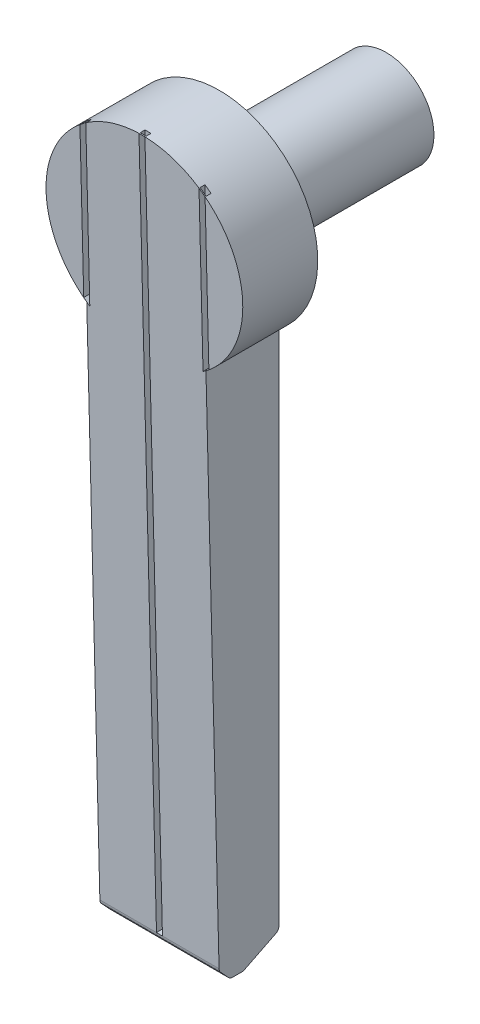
ISO-10303-21;
HEADER;
FILE_DESCRIPTION(('STEP AP214'),'2;1');
FILE_NAME('part.step','',(''),(''),'','','');
FILE_SCHEMA(('AUTOMOTIVE_DESIGN { 1 0 10303 214 1 1 1 1 }'));
ENDSEC;
DATA;
#1=APPLICATION_CONTEXT('core data for automotive mechanical design processes');
#2=APPLICATION_PROTOCOL_DEFINITION('international standard','automotive_design',2000,#1);
#3=PRODUCT_CONTEXT('',#1,'mechanical');
#4=PRODUCT('Part','Part','',(#3));
#5=PRODUCT_RELATED_PRODUCT_CATEGORY('part','',(#4));
#6=PRODUCT_DEFINITION_FORMATION('','',#4);
#7=PRODUCT_DEFINITION_CONTEXT('part definition',#1,'design');
#8=PRODUCT_DEFINITION('design','',#6,#7);
#9=PRODUCT_DEFINITION_SHAPE('','',#8);
#10=(LENGTH_UNIT() NAMED_UNIT(*) SI_UNIT(.MILLI.,.METRE.));
#11=(NAMED_UNIT(*) PLANE_ANGLE_UNIT() SI_UNIT($,.RADIAN.));
#12=(NAMED_UNIT(*) SI_UNIT($,.STERADIAN.) SOLID_ANGLE_UNIT());
#13=UNCERTAINTY_MEASURE_WITH_UNIT(LENGTH_MEASURE(1.E-05),#10,'distance_accuracy_value','');
#14=(GEOMETRIC_REPRESENTATION_CONTEXT(3) GLOBAL_UNCERTAINTY_ASSIGNED_CONTEXT((#13)) GLOBAL_UNIT_ASSIGNED_CONTEXT((#10,
#11,#12)) REPRESENTATION_CONTEXT('',''));
#15=CARTESIAN_POINT('',(0.,0.,0.));
#16=DIRECTION('',(0.,0.,1.));
#17=DIRECTION('',(1.,0.,0.));
#18=AXIS2_PLACEMENT_3D('',#15,#16,#17);
#19=CARTESIAN_POINT('',(240.,60.,13.));
#20=DIRECTION('',(0.,0.0249921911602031,-0.999687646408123));
#21=DIRECTION('',(0.,0.999687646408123,0.0249921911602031));
#22=AXIS2_PLACEMENT_3D('',#19,#20,#21);
#23=PLANE('',#22);
#24=DIRECTION('',(0.,-0.999687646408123,-0.0249921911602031));
#25=VECTOR('',#24,1.);
#26=CARTESIAN_POINT('',(0.500000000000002,-106.057500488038,8.84856248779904));
#27=LINE('',#26,#25);
#28=CARTESIAN_POINT('',(0.500000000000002,59.9872710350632,12.9996817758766));
#29=VERTEX_POINT('',#28);
#30=CARTESIAN_POINT('',(0.500000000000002,-57.6228801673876,10.0594279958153));
#31=VERTEX_POINT('',#30);
#32=EDGE_CURVE('E255',#29,#31,#27,.T.);
#33=ORIENTED_EDGE('',*,*,#32,.T.);
#34=DIRECTION('',(1.,0.,0.));
#35=VECTOR('',#34,1.);
#36=CARTESIAN_POINT('',(240.,-57.6228801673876,10.0594279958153));
#37=LINE('',#36,#35);
#38=CARTESIAN_POINT('',(10.,-57.6228801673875,10.0594279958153));
#39=VERTEX_POINT('',#38);
#40=EDGE_CURVE('E366',#31,#39,#37,.T.);
#41=ORIENTED_EDGE('',*,*,#40,.T.);
#42=DIRECTION('',(0.,-0.999687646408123,-0.0249921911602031));
#43=VECTOR('',#42,1.);
#44=CARTESIAN_POINT('',(10.,-59.9250468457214,10.001873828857));
#45=LINE('',#44,#43);
#46=CARTESIAN_POINT('',(10.,30.3755952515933,12.2593898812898));
#47=VERTEX_POINT('',#46);
#48=EDGE_CURVE('E309',#47,#39,#45,.T.);
#49=ORIENTED_EDGE('',*,*,#48,.F.);
#50=CARTESIAN_POINT('',(0.,43.5,12.5875));
#51=DIRECTION('',(0.,0.0249921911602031,-0.999687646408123));
#52=DIRECTION('',(0.,-0.999687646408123,-0.0249921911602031));
#53=AXIS2_PLACEMENT_3D('',#50,#51,#52);
#54=ELLIPSE('',#53,16.5051554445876,16.5);
#55=CARTESIAN_POINT('',(-10.,30.3755952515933,12.2593898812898));
#56=VERTEX_POINT('',#55);
#57=EDGE_CURVE('E307',#56,#47,#54,.T.);
#58=ORIENTED_EDGE('',*,*,#57,.F.);
#59=DIRECTION('',(0.,0.999687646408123,0.0249921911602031));
#60=VECTOR('',#59,1.);
#61=CARTESIAN_POINT('',(-10.,-59.9250468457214,10.001873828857));
#62=LINE('',#61,#60);
#63=CARTESIAN_POINT('',(-10.,-57.6228801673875,10.0594279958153));
#64=VERTEX_POINT('',#63);
#65=EDGE_CURVE('E312',#64,#56,#62,.T.);
#66=ORIENTED_EDGE('',*,*,#65,.F.);
#67=CARTESIAN_POINT('',(-0.5,-57.6228801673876,10.0594279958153));
#68=VERTEX_POINT('',#67);
#69=EDGE_CURVE('E367',#64,#68,#37,.T.);
#70=ORIENTED_EDGE('',*,*,#69,.T.);
#71=DIRECTION('',(0.,0.999687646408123,0.0249921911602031));
#72=VECTOR('',#71,1.);
#73=CARTESIAN_POINT('',(-0.499999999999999,-106.057500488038,8.84856248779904));
#74=LINE('',#73,#72);
#75=CARTESIAN_POINT('',(-0.499999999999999,59.9872710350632,12.9996817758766));
#76=VERTEX_POINT('',#75);
#77=EDGE_CURVE('E277',#68,#76,#74,.T.);
#78=ORIENTED_EDGE('',*,*,#77,.T.);
#79=CARTESIAN_POINT('',(0.,43.5,12.5875));
#80=DIRECTION('',(0.,-0.0249921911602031,0.999687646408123));
#81=DIRECTION('',(0.,-0.999687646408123,-0.0249921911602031));
#82=AXIS2_PLACEMENT_3D('',#79,#80,#81);
#83=CIRCLE('',#82,16.5);
#84=EDGE_CURVE('E274',#29,#76,#83,.T.);
#85=ORIENTED_EDGE('',*,*,#84,.F.);
#86=EDGE_LOOP('',(#33,#41,#49,#58,#66,#70,#78,#85));
#87=FACE_BOUND('',#86,.T.);
#88=CARTESIAN_POINT('',(0.,43.5,12.5875));
#89=DIRECTION('',(0.,-0.0249921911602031,0.999687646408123));
#90=DIRECTION('',(0.,-0.999687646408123,-0.0249921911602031));
#91=AXIS2_PLACEMENT_3D('',#88,#89,#90);
#92=CIRCLE('',#91,16.5);
#93=CARTESIAN_POINT('',(10.5,56.2239464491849,12.9055986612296));
#94=VERTEX_POINT('',#93);
#95=CARTESIAN_POINT('',(9.50000000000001,56.9865236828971,12.9246630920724));
#96=VERTEX_POINT('',#95);
#97=EDGE_CURVE('E245',#94,#96,#92,.T.);
#98=ORIENTED_EDGE('',*,*,#97,.F.);
#99=DIRECTION('',(0.,0.999687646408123,0.0249921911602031));
#100=VECTOR('',#99,1.);
#101=CARTESIAN_POINT('',(10.5,-106.057500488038,8.84856248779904));
#102=LINE('',#101,#100);
#103=CARTESIAN_POINT('',(10.5,30.7760535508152,12.2694013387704));
#104=VERTEX_POINT('',#103);
#105=EDGE_CURVE('E230',#104,#94,#102,.T.);
#106=ORIENTED_EDGE('',*,*,#105,.F.);
#107=CARTESIAN_POINT('',(0.,43.5,12.5875));
#108=DIRECTION('',(0.,-0.0249921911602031,0.999687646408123));
#109=DIRECTION('',(0.,-0.999687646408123,-0.0249921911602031));
#110=AXIS2_PLACEMENT_3D('',#107,#108,#109);
#111=CIRCLE('',#110,16.5);
#112=CARTESIAN_POINT('',(9.50000000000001,30.0134763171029,12.2503369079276));
#113=VERTEX_POINT('',#112);
#114=EDGE_CURVE('E237',#113,#104,#111,.T.);
#115=ORIENTED_EDGE('',*,*,#114,.F.);
#116=DIRECTION('',(0.,0.999687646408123,0.0249921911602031));
#117=VECTOR('',#116,1.);
#118=CARTESIAN_POINT('',(9.50000000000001,-106.057500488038,8.84856248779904));
#119=LINE('',#118,#117);
#120=EDGE_CURVE('E248',#113,#96,#119,.T.);
#121=ORIENTED_EDGE('',*,*,#120,.T.);
#122=EDGE_LOOP('',(#98,#106,#115,#121));
#123=FACE_BOUND('',#122,.T.);
#124=CARTESIAN_POINT('',(0.,43.5,12.5875));
#125=DIRECTION('',(0.,-0.0249921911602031,0.999687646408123));
#126=DIRECTION('',(0.,-0.999687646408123,-0.0249921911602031));
#127=AXIS2_PLACEMENT_3D('',#124,#125,#126);
#128=CIRCLE('',#127,16.5);
#129=CARTESIAN_POINT('',(-9.49999999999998,30.0134763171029,12.2503369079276));
#130=VERTEX_POINT('',#129);
#131=CARTESIAN_POINT('',(-10.5,30.7760535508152,12.2694013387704));
#132=VERTEX_POINT('',#131);
#133=EDGE_CURVE('E47',#130,#132,#128,.F.);
#134=ORIENTED_EDGE('',*,*,#133,.T.);
#135=DIRECTION('',(0.,0.999687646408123,0.0249921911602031));
#136=VECTOR('',#135,1.);
#137=CARTESIAN_POINT('',(-10.5,-106.057500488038,8.84856248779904));
#138=LINE('',#137,#136);
#139=CARTESIAN_POINT('',(-10.5,56.2239464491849,12.9055986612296));
#140=VERTEX_POINT('',#139);
#141=EDGE_CURVE('E210',#132,#140,#138,.T.);
#142=ORIENTED_EDGE('',*,*,#141,.T.);
#143=CARTESIAN_POINT('',(0.,43.5,12.5875));
#144=DIRECTION('',(0.,-0.0249921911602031,0.999687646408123));
#145=DIRECTION('',(0.,-0.999687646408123,-0.0249921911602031));
#146=AXIS2_PLACEMENT_3D('',#143,#144,#145);
#147=CIRCLE('',#146,16.5);
#148=CARTESIAN_POINT('',(-9.49999999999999,56.9865236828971,12.9246630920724));
#149=VERTEX_POINT('',#148);
#150=EDGE_CURVE('E223',#149,#140,#147,.T.);
#151=ORIENTED_EDGE('',*,*,#150,.F.);
#152=DIRECTION('',(0.,0.999687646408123,0.0249921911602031));
#153=VECTOR('',#152,1.);
#154=CARTESIAN_POINT('',(-9.50000000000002,-106.057500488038,8.84856248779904));
#155=LINE('',#154,#153);
#156=EDGE_CURVE('E221',#130,#149,#155,.T.);
#157=ORIENTED_EDGE('',*,*,#156,.F.);
#158=EDGE_LOOP('',(#134,#142,#151,#157));
#159=FACE_BOUND('',#158,.T.);
#160=ADVANCED_FACE('F32',(#87,#123,#159),#23,.F.);
#161=CARTESIAN_POINT('',(0.,43.5,13.));
#162=DIRECTION('',(0.,0.,-1.));
#163=DIRECTION('',(-1.,0.,0.));
#164=AXIS2_PLACEMENT_3D('',#161,#162,#163);
#165=CYLINDRICAL_SURFACE('',#164,16.5);
#166=DIRECTION('',(0.,0.,-1.));
#167=VECTOR('',#166,1.);
#168=CARTESIAN_POINT('',(-10.,30.3755952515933,13.));
#169=LINE('',#168,#167);
#170=CARTESIAN_POINT('',(-10.,30.3755952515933,0.));
#171=VERTEX_POINT('',#170);
#172=EDGE_CURVE('E325',#56,#171,#169,.T.);
#173=ORIENTED_EDGE('',*,*,#172,.F.);
#174=ORIENTED_EDGE('',*,*,#57,.T.);
#175=DIRECTION('',(0.,0.,-1.));
#176=VECTOR('',#175,1.);
#177=CARTESIAN_POINT('',(10.,30.3755952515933,13.));
#178=LINE('',#177,#176);
#179=CARTESIAN_POINT('',(10.,30.3755952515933,0.));
#180=VERTEX_POINT('',#179);
#181=EDGE_CURVE('E327',#47,#180,#178,.T.);
#182=ORIENTED_EDGE('',*,*,#181,.T.);
#183=CARTESIAN_POINT('',(0.,43.5,0.));
#184=DIRECTION('',(0.,0.,1.));
#185=DIRECTION('',(1.,0.,0.));
#186=AXIS2_PLACEMENT_3D('',#183,#184,#185);
#187=CIRCLE('',#186,16.5);
#188=EDGE_CURVE('E322',#180,#171,#187,.T.);
#189=ORIENTED_EDGE('',*,*,#188,.T.);
#190=EDGE_LOOP('',(#173,#174,#182,#189));
#191=FACE_BOUND('',#190,.T.);
#192=DIRECTION('',(0.,0.,-1.));
#193=VECTOR('',#192,1.);
#194=CARTESIAN_POINT('',(0.500000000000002,59.9924225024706,13.));
#195=LINE('',#194,#193);
#196=CARTESIAN_POINT('',(0.500000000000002,59.9924225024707,12.7936230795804));
#197=VERTEX_POINT('',#196);
#198=CARTESIAN_POINT('',(0.500000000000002,59.9924225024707,11.9994981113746));
#199=VERTEX_POINT('',#198);
#200=EDGE_CURVE('E292',#197,#199,#195,.T.);
#201=ORIENTED_EDGE('',*,*,#200,.F.);
#202=CARTESIAN_POINT('',(0.,43.5,12.5875));
#203=DIRECTION('',(0.,0.0124970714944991,-0.999921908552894));
#204=DIRECTION('',(0.,-0.999921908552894,-0.0124970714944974));
#205=AXIS2_PLACEMENT_3D('',#202,#203,#204);
#206=ELLIPSE('',#205,16.5012886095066,16.5);
#207=CARTESIAN_POINT('',(-0.499999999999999,59.9924225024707,12.7936230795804));
#208=VERTEX_POINT('',#207);
#209=EDGE_CURVE('E295',#197,#208,#206,.F.);
#210=ORIENTED_EDGE('',*,*,#209,.T.);
#211=DIRECTION('',(0.,0.,-1.));
#212=VECTOR('',#211,1.);
#213=CARTESIAN_POINT('',(-0.499999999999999,59.9924225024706,13.));
#214=LINE('',#213,#212);
#215=CARTESIAN_POINT('',(-0.499999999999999,59.9924225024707,11.9994981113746));
#216=VERTEX_POINT('',#215);
#217=EDGE_CURVE('E284',#216,#208,#214,.F.);
#218=ORIENTED_EDGE('',*,*,#217,.F.);
#219=CARTESIAN_POINT('',(0.,43.5,11.5871875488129));
#220=DIRECTION('',(0.,-0.0249921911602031,0.999687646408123));
#221=DIRECTION('',(0.,-0.999687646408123,-0.0249921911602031));
#222=AXIS2_PLACEMENT_3D('',#219,#220,#221);
#223=ELLIPSE('',#222,16.5051554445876,16.5);
#224=EDGE_CURVE('E379',#199,#216,#223,.T.);
#225=ORIENTED_EDGE('',*,*,#224,.F.);
#226=EDGE_LOOP('',(#201,#210,#218,#225));
#227=FACE_BOUND('',#226,.T.);
#228=DIRECTION('',(0.,0.,-1.));
#229=VECTOR('',#228,1.);
#230=CARTESIAN_POINT('',(10.5,56.2279220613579,13.));
#231=LINE('',#230,#229);
#232=CARTESIAN_POINT('',(10.5,56.2279220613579,11.9053856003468));
#233=VERTEX_POINT('',#232);
#234=CARTESIAN_POINT('',(10.5,56.2279220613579,12.7465741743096));
#235=VERTEX_POINT('',#234);
#236=EDGE_CURVE('E385',#233,#235,#231,.F.);
#237=ORIENTED_EDGE('',*,*,#236,.T.);
#238=CARTESIAN_POINT('',(0.,43.5,12.5875));
#239=DIRECTION('',(0.,0.0124970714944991,-0.999921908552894));
#240=DIRECTION('',(0.,-0.999921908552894,-0.0124970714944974));
#241=AXIS2_PLACEMENT_3D('',#238,#239,#240);
#242=ELLIPSE('',#241,16.5012886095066,16.5);
#243=CARTESIAN_POINT('',(9.50000000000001,56.9907375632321,12.7561078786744));
#244=VERTEX_POINT('',#243);
#245=EDGE_CURVE('E388',#235,#244,#242,.F.);
#246=ORIENTED_EDGE('',*,*,#245,.T.);
#247=DIRECTION('',(0.,0.,-1.));
#248=VECTOR('',#247,1.);
#249=CARTESIAN_POINT('',(9.50000000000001,56.990737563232,13.));
#250=LINE('',#249,#248);
#251=CARTESIAN_POINT('',(9.50000000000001,56.9907375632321,11.9244559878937));
#252=VERTEX_POINT('',#251);
#253=EDGE_CURVE('E383',#252,#244,#250,.F.);
#254=ORIENTED_EDGE('',*,*,#253,.F.);
#255=CARTESIAN_POINT('',(0.,43.5,11.5871875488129));
#256=DIRECTION('',(0.,-0.0249921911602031,0.999687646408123));
#257=DIRECTION('',(0.,-0.999687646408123,-0.0249921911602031));
#258=AXIS2_PLACEMENT_3D('',#255,#256,#257);
#259=ELLIPSE('',#258,16.5051554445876,16.5);
#260=EDGE_CURVE('E381',#233,#252,#259,.T.);
#261=ORIENTED_EDGE('',*,*,#260,.F.);
#262=EDGE_LOOP('',(#237,#246,#254,#261));
#263=FACE_BOUND('',#262,.T.);
#264=DIRECTION('',(0.,0.,-1.));
#265=VECTOR('',#264,1.);
#266=CARTESIAN_POINT('',(-10.5,56.2279220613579,13.));
#267=LINE('',#266,#265);
#268=CARTESIAN_POINT('',(-10.5,56.2279220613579,11.9053856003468));
#269=VERTEX_POINT('',#268);
#270=CARTESIAN_POINT('',(-10.5,56.2279220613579,12.7465741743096));
#271=VERTEX_POINT('',#270);
#272=EDGE_CURVE('E11',#269,#271,#267,.F.);
#273=ORIENTED_EDGE('',*,*,#272,.F.);
#274=CARTESIAN_POINT('',(0.,43.5,11.5871875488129));
#275=DIRECTION('',(0.,-0.0249921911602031,0.999687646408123));
#276=DIRECTION('',(0.,-0.999687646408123,-0.0249921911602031));
#277=AXIS2_PLACEMENT_3D('',#274,#275,#276);
#278=ELLIPSE('',#277,16.5051554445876,16.5);
#279=CARTESIAN_POINT('',(-9.49999999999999,56.9907375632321,11.9244559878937));
#280=VERTEX_POINT('',#279);
#281=EDGE_CURVE('E391',#280,#269,#278,.T.);
#282=ORIENTED_EDGE('',*,*,#281,.F.);
#283=DIRECTION('',(0.,0.,-1.));
#284=VECTOR('',#283,1.);
#285=CARTESIAN_POINT('',(-9.49999999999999,56.990737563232,13.));
#286=LINE('',#285,#284);
#287=CARTESIAN_POINT('',(-9.49999999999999,56.990737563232,12.7561078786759));
#288=VERTEX_POINT('',#287);
#289=EDGE_CURVE('E215',#280,#288,#286,.F.);
#290=ORIENTED_EDGE('',*,*,#289,.T.);
#291=CARTESIAN_POINT('',(0.,43.5,12.5875));
#292=DIRECTION('',(0.,0.0124970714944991,-0.999921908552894));
#293=DIRECTION('',(0.,-0.999921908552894,-0.0124970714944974));
#294=AXIS2_PLACEMENT_3D('',#291,#292,#293);
#295=ELLIPSE('',#294,16.5012886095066,16.5);
#296=EDGE_CURVE('E40',#288,#271,#295,.F.);
#297=ORIENTED_EDGE('',*,*,#296,.T.);
#298=EDGE_LOOP('',(#273,#282,#290,#297));
#299=FACE_BOUND('',#298,.T.);
#300=ADVANCED_FACE('F396',(#191,#227,#263,#299),#165,.T.);
#301=CARTESIAN_POINT('',(0.,43.5,0.));
#302=DIRECTION('',(0.,0.,1.));
#303=DIRECTION('',(1.,0.,0.));
#304=AXIS2_PLACEMENT_3D('',#301,#302,#303);
#305=PLANE('',#304);
#306=DIRECTION('',(0.,1.,0.));
#307=VECTOR('',#306,1.);
#308=CARTESIAN_POINT('',(10.,-60.,0.));
#309=LINE('',#308,#307);
#310=CARTESIAN_POINT('',(10.,-56.3819660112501,0.));
#311=VERTEX_POINT('',#310);
#312=EDGE_CURVE('E320',#311,#180,#309,.T.);
#313=ORIENTED_EDGE('',*,*,#312,.F.);
#314=DIRECTION('',(-1.,0.,0.));
#315=VECTOR('',#314,1.);
#316=CARTESIAN_POINT('',(0.,-56.3819660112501,0.));
#317=LINE('',#316,#315);
#318=CARTESIAN_POINT('',(-10.,-56.3819660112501,0.));
#319=VERTEX_POINT('',#318);
#320=EDGE_CURVE('E342',#311,#319,#317,.T.);
#321=ORIENTED_EDGE('',*,*,#320,.T.);
#322=DIRECTION('',(0.,-1.,0.));
#323=VECTOR('',#322,1.);
#324=CARTESIAN_POINT('',(-10.,-60.,0.));
#325=LINE('',#324,#323);
#326=EDGE_CURVE('E317',#171,#319,#325,.T.);
#327=ORIENTED_EDGE('',*,*,#326,.F.);
#328=ORIENTED_EDGE('',*,*,#188,.F.);
#329=EDGE_LOOP('',(#313,#321,#327,#328));
#330=FACE_BOUND('',#329,.T.);
#331=CARTESIAN_POINT('',(0.,43.5,0.));
#332=DIRECTION('',(0.,0.,1.));
#333=DIRECTION('',(1.,0.,0.));
#334=AXIS2_PLACEMENT_3D('',#331,#332,#333);
#335=CIRCLE('',#334,8.);
#336=CARTESIAN_POINT('',(8.00000000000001,43.5,0.));
#337=VERTEX_POINT('',#336);
#338=EDGE_CURVE('E336',#337,#337,#335,.F.);
#339=ORIENTED_EDGE('',*,*,#338,.F.);
#340=EDGE_LOOP('',(#339));
#341=FACE_BOUND('',#340,.T.);
#342=ADVANCED_FACE('F422',(#330,#341),#305,.F.);
#343=CARTESIAN_POINT('',(-10.,-60.,13.));
#344=DIRECTION('',(1.,0.,0.));
#345=DIRECTION('',(0.,0.,-1.));
#346=AXIS2_PLACEMENT_3D('',#343,#344,#345);
#347=PLANE('',#346);
#348=ORIENTED_EDGE('',*,*,#326,.T.);
#349=CARTESIAN_POINT('',(-10.,-56.3819660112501,1.));
#350=DIRECTION('',(1.,0.,0.));
#351=DIRECTION('',(0.,0.,-1.));
#352=AXIS2_PLACEMENT_3D('',#349,#350,#351);
#353=CIRCLE('',#352,1.);
#354=CARTESIAN_POINT('',(-10.,-57.27639320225,0.552786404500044));
#355=VERTEX_POINT('',#354);
#356=EDGE_CURVE('E351',#319,#355,#353,.F.);
#357=ORIENTED_EDGE('',*,*,#356,.T.);
#358=DIRECTION('',(0.,0.447213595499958,-0.894427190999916));
#359=VECTOR('',#358,1.);
#360=CARTESIAN_POINT('',(-10.,-60.,6.));
#361=LINE('',#360,#359);
#362=CARTESIAN_POINT('',(-10.,-59.8944271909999,5.78885438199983));
#363=VERTEX_POINT('',#362);
#364=EDGE_CURVE('E298',#363,#355,#361,.T.);
#365=ORIENTED_EDGE('',*,*,#364,.F.);
#366=CARTESIAN_POINT('',(-10.,-59.,6.23606797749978));
#367=DIRECTION('',(1.,0.,0.));
#368=DIRECTION('',(0.,0.,-1.));
#369=AXIS2_PLACEMENT_3D('',#366,#367,#368);
#370=CIRCLE('',#369,1.);
#371=CARTESIAN_POINT('',(-10.,-60.,6.23606797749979));
#372=VERTEX_POINT('',#371);
#373=EDGE_CURVE('E345',#363,#372,#370,.F.);
#374=ORIENTED_EDGE('',*,*,#373,.T.);
#375=DIRECTION('',(0.,0.,-1.));
#376=VECTOR('',#375,1.);
#377=CARTESIAN_POINT('',(-10.,-60.,13.));
#378=LINE('',#377,#376);
#379=CARTESIAN_POINT('',(-10.,-60.,7.76278672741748));
#380=VERTEX_POINT('',#379);
#381=EDGE_CURVE('E333',#380,#372,#378,.T.);
#382=ORIENTED_EDGE('',*,*,#381,.F.);
#383=CARTESIAN_POINT('',(-10.,-59.,7.76278672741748));
#384=DIRECTION('',(1.,0.,0.));
#385=DIRECTION('',(0.,0.,-1.));
#386=AXIS2_PLACEMENT_3D('',#383,#384,#385);
#387=CIRCLE('',#386,1.);
#388=CARTESIAN_POINT('',(-10.,-59.6790419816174,8.49688616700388));
#389=VERTEX_POINT('',#388);
#390=EDGE_CURVE('E347',#380,#389,#387,.F.);
#391=ORIENTED_EDGE('',*,*,#390,.T.);
#392=DIRECTION('',(0.,-0.734099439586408,-0.679041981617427));
#393=VECTOR('',#392,1.);
#394=CARTESIAN_POINT('',(-10.,-58.,10.05));
#395=LINE('',#394,#393);
#396=CARTESIAN_POINT('',(-10.,-58.2769299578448,9.79383978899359));
#397=VERTEX_POINT('',#396);
#398=EDGE_CURVE('E301',#397,#389,#395,.T.);
#399=ORIENTED_EDGE('',*,*,#398,.F.);
#400=CARTESIAN_POINT('',(-10.,-57.5978879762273,9.05974034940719));
#401=DIRECTION('',(1.,0.,0.));
#402=DIRECTION('',(0.,0.,-1.));
#403=AXIS2_PLACEMENT_3D('',#400,#401,#402);
#404=CIRCLE('',#403,1.);
#405=EDGE_CURVE('E349',#397,#64,#404,.F.);
#406=ORIENTED_EDGE('',*,*,#405,.T.);
#407=ORIENTED_EDGE('',*,*,#65,.T.);
#408=ORIENTED_EDGE('',*,*,#172,.T.);
#409=EDGE_LOOP('',(#348,#357,#365,#374,#382,#391,#399,#406,#407,#408));
#410=FACE_BOUND('',#409,.T.);
#411=ADVANCED_FACE('F440',(#410),#347,.F.);
#412=CARTESIAN_POINT('',(-10.,-60.,13.));
#413=DIRECTION('',(0.,1.,0.));
#414=DIRECTION('',(0.,0.,1.));
#415=AXIS2_PLACEMENT_3D('',#412,#413,#414);
#416=PLANE('',#415);
#417=DIRECTION('',(0.,0.,-1.));
#418=VECTOR('',#417,1.);
#419=CARTESIAN_POINT('',(10.,-60.,13.));
#420=LINE('',#419,#418);
#421=CARTESIAN_POINT('',(10.,-60.,7.76278672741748));
#422=VERTEX_POINT('',#421);
#423=CARTESIAN_POINT('',(10.,-60.,6.23606797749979));
#424=VERTEX_POINT('',#423);
#425=EDGE_CURVE('E330',#422,#424,#420,.T.);
#426=ORIENTED_EDGE('',*,*,#425,.F.);
#427=DIRECTION('',(-1.,0.,0.));
#428=VECTOR('',#427,1.);
#429=CARTESIAN_POINT('',(-10.,-60.,7.76278672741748));
#430=LINE('',#429,#428);
#431=EDGE_CURVE('E376',#422,#380,#430,.T.);
#432=ORIENTED_EDGE('',*,*,#431,.T.);
#433=ORIENTED_EDGE('',*,*,#381,.T.);
#434=DIRECTION('',(-1.,0.,0.));
#435=VECTOR('',#434,1.);
#436=CARTESIAN_POINT('',(-10.,-60.,6.23606797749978));
#437=LINE('',#436,#435);
#438=EDGE_CURVE('E374',#372,#424,#437,.F.);
#439=ORIENTED_EDGE('',*,*,#438,.T.);
#440=EDGE_LOOP('',(#426,#432,#433,#439));
#441=FACE_BOUND('',#440,.T.);
#442=ADVANCED_FACE('F445',(#441),#416,.F.);
#443=CARTESIAN_POINT('',(10.,-60.,13.));
#444=DIRECTION('',(-1.,0.,0.));
#445=DIRECTION('',(0.,0.,1.));
#446=AXIS2_PLACEMENT_3D('',#443,#444,#445);
#447=PLANE('',#446);
#448=DIRECTION('',(0.,0.447213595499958,-0.894427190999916));
#449=VECTOR('',#448,1.);
#450=CARTESIAN_POINT('',(10.,-62.8,11.6));
#451=LINE('',#450,#449);
#452=CARTESIAN_POINT('',(10.,-59.8944271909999,5.78885438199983));
#453=VERTEX_POINT('',#452);
#454=CARTESIAN_POINT('',(10.,-57.27639320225,0.552786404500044));
#455=VERTEX_POINT('',#454);
#456=EDGE_CURVE('E339',#453,#455,#451,.T.);
#457=ORIENTED_EDGE('',*,*,#456,.T.);
#458=CARTESIAN_POINT('',(10.,-56.3819660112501,1.));
#459=DIRECTION('',(-1.,0.,0.));
#460=DIRECTION('',(0.,0.,1.));
#461=AXIS2_PLACEMENT_3D('',#458,#459,#460);
#462=CIRCLE('',#461,1.);
#463=EDGE_CURVE('E364',#455,#311,#462,.F.);
#464=ORIENTED_EDGE('',*,*,#463,.T.);
#465=ORIENTED_EDGE('',*,*,#312,.T.);
#466=ORIENTED_EDGE('',*,*,#181,.F.);
#467=ORIENTED_EDGE('',*,*,#48,.T.);
#468=CARTESIAN_POINT('',(10.,-57.5978879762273,9.05974034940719));
#469=DIRECTION('',(-1.,0.,0.));
#470=DIRECTION('',(0.,0.,1.));
#471=AXIS2_PLACEMENT_3D('',#468,#469,#470);
#472=CIRCLE('',#471,1.);
#473=CARTESIAN_POINT('',(10.,-58.2769299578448,9.79383978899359));
#474=VERTEX_POINT('',#473);
#475=EDGE_CURVE('E362',#39,#474,#472,.F.);
#476=ORIENTED_EDGE('',*,*,#475,.T.);
#477=DIRECTION('',(0.,-0.734099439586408,-0.679041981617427));
#478=VECTOR('',#477,1.);
#479=CARTESIAN_POINT('',(10.,-57.6072751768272,10.4132704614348));
#480=LINE('',#479,#478);
#481=CARTESIAN_POINT('',(10.,-59.6790419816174,8.49688616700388));
#482=VERTEX_POINT('',#481);
#483=EDGE_CURVE('E304',#474,#482,#480,.T.);
#484=ORIENTED_EDGE('',*,*,#483,.T.);
#485=CARTESIAN_POINT('',(10.,-59.,7.76278672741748));
#486=DIRECTION('',(-1.,0.,0.));
#487=DIRECTION('',(0.,0.,1.));
#488=AXIS2_PLACEMENT_3D('',#485,#486,#487);
#489=CIRCLE('',#488,1.);
#490=EDGE_CURVE('E360',#482,#422,#489,.F.);
#491=ORIENTED_EDGE('',*,*,#490,.T.);
#492=ORIENTED_EDGE('',*,*,#425,.T.);
#493=CARTESIAN_POINT('',(10.,-59.,6.23606797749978));
#494=DIRECTION('',(-1.,0.,0.));
#495=DIRECTION('',(0.,0.,1.));
#496=AXIS2_PLACEMENT_3D('',#493,#494,#495);
#497=CIRCLE('',#496,1.);
#498=EDGE_CURVE('E358',#424,#453,#497,.F.);
#499=ORIENTED_EDGE('',*,*,#498,.T.);
#500=EDGE_LOOP('',(#457,#464,#465,#466,#467,#476,#484,#491,#492,#499));
#501=FACE_BOUND('',#500,.T.);
#502=ADVANCED_FACE('F437',(#501),#447,.F.);
#503=CARTESIAN_POINT('',(0.,43.5,-28.));
#504=DIRECTION('',(0.,0.,1.));
#505=DIRECTION('',(1.,0.,0.));
#506=AXIS2_PLACEMENT_3D('',#503,#504,#505);
#507=CYLINDRICAL_SURFACE('',#506,8.);
#508=CARTESIAN_POINT('',(0.,43.5,-28.));
#509=DIRECTION('',(0.,0.,-1.));
#510=DIRECTION('',(-1.,0.,0.));
#511=AXIS2_PLACEMENT_3D('',#508,#509,#510);
#512=CIRCLE('',#511,8.);
#513=CARTESIAN_POINT('',(-7.99999999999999,43.5,-28.));
#514=VERTEX_POINT('',#513);
#515=EDGE_CURVE('E314',#514,#514,#512,.T.);
#516=ORIENTED_EDGE('',*,*,#515,.F.);
#517=EDGE_LOOP('',(#516));
#518=FACE_BOUND('',#517,.T.);
#519=ORIENTED_EDGE('',*,*,#338,.T.);
#520=EDGE_LOOP('',(#519));
#521=FACE_BOUND('',#520,.T.);
#522=ADVANCED_FACE('F433',(#518,#521),#507,.T.);
#523=CARTESIAN_POINT('',(0.,43.5,-28.));
#524=DIRECTION('',(0.,0.,-1.));
#525=DIRECTION('',(-1.,0.,0.));
#526=AXIS2_PLACEMENT_3D('',#523,#524,#525);
#527=PLANE('',#526);
#528=ORIENTED_EDGE('',*,*,#515,.T.);
#529=EDGE_LOOP('',(#528));
#530=FACE_BOUND('',#529,.T.);
#531=ADVANCED_FACE('F430',(#530),#527,.T.);
#532=CARTESIAN_POINT('',(16.5,-58.,10.05));
#533=DIRECTION('',(0.,0.679041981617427,-0.734099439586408));
#534=DIRECTION('',(0.,0.734099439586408,0.679041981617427));
#535=AXIS2_PLACEMENT_3D('',#532,#533,#534);
#536=PLANE('',#535);
#537=ORIENTED_EDGE('',*,*,#483,.F.);
#538=DIRECTION('',(1.,0.,0.));
#539=VECTOR('',#538,1.);
#540=CARTESIAN_POINT('',(16.5,-58.2769299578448,9.79383978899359));
#541=LINE('',#540,#539);
#542=EDGE_CURVE('E372',#474,#397,#541,.F.);
#543=ORIENTED_EDGE('',*,*,#542,.T.);
#544=ORIENTED_EDGE('',*,*,#398,.T.);
#545=DIRECTION('',(-1.,0.,0.));
#546=VECTOR('',#545,1.);
#547=CARTESIAN_POINT('',(16.5,-59.6790419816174,8.49688616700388));
#548=LINE('',#547,#546);
#549=EDGE_CURVE('E370',#389,#482,#548,.F.);
#550=ORIENTED_EDGE('',*,*,#549,.T.);
#551=EDGE_LOOP('',(#537,#543,#544,#550));
#552=FACE_BOUND('',#551,.T.);
#553=ADVANCED_FACE('F428',(#552),#536,.F.);
#554=CARTESIAN_POINT('',(16.5,-60.,6.));
#555=DIRECTION('',(0.,0.894427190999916,0.447213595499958));
#556=DIRECTION('',(0.,-0.447213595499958,0.894427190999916));
#557=AXIS2_PLACEMENT_3D('',#554,#555,#556);
#558=PLANE('',#557);
#559=ORIENTED_EDGE('',*,*,#364,.T.);
#560=DIRECTION('',(-1.,0.,0.));
#561=VECTOR('',#560,1.);
#562=CARTESIAN_POINT('',(16.5,-57.27639320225,0.552786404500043));
#563=LINE('',#562,#561);
#564=EDGE_CURVE('E356',#355,#455,#563,.F.);
#565=ORIENTED_EDGE('',*,*,#564,.T.);
#566=ORIENTED_EDGE('',*,*,#456,.F.);
#567=DIRECTION('',(-1.,0.,0.));
#568=VECTOR('',#567,1.);
#569=CARTESIAN_POINT('',(16.5,-59.8944271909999,5.78885438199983));
#570=LINE('',#569,#568);
#571=EDGE_CURVE('E353',#453,#363,#570,.T.);
#572=ORIENTED_EDGE('',*,*,#571,.T.);
#573=EDGE_LOOP('',(#559,#565,#566,#572));
#574=FACE_BOUND('',#573,.T.);
#575=ADVANCED_FACE('F457',(#574),#558,.F.);
#576=CARTESIAN_POINT('',(0.,-56.3819660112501,1.));
#577=DIRECTION('',(-1.,0.,0.));
#578=DIRECTION('',(0.,0.,1.));
#579=AXIS2_PLACEMENT_3D('',#576,#577,#578);
#580=CYLINDRICAL_SURFACE('',#579,1.);
#581=ORIENTED_EDGE('',*,*,#463,.F.);
#582=ORIENTED_EDGE('',*,*,#564,.F.);
#583=ORIENTED_EDGE('',*,*,#356,.F.);
#584=ORIENTED_EDGE('',*,*,#320,.F.);
#585=EDGE_LOOP('',(#581,#582,#583,#584));
#586=FACE_BOUND('',#585,.T.);
#587=ADVANCED_FACE('F453',(#586),#580,.T.);
#588=CARTESIAN_POINT('',(240.,-57.5978879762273,9.05974034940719));
#589=DIRECTION('',(1.,0.,0.));
#590=DIRECTION('',(0.,0.,-1.));
#591=AXIS2_PLACEMENT_3D('',#588,#589,#590);
#592=CYLINDRICAL_SURFACE('',#591,1.);
#593=ORIENTED_EDGE('',*,*,#405,.F.);
#594=ORIENTED_EDGE('',*,*,#542,.F.);
#595=ORIENTED_EDGE('',*,*,#475,.F.);
#596=ORIENTED_EDGE('',*,*,#40,.F.);
#597=DIRECTION('',(1.,0.,0.));
#598=VECTOR('',#597,1.);
#599=CARTESIAN_POINT('',(0.41236673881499,-57.6228801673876,10.0594279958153));
#600=LINE('',#599,#598);
#601=EDGE_CURVE('E265',#68,#31,#600,.T.);
#602=ORIENTED_EDGE('',*,*,#601,.F.);
#603=ORIENTED_EDGE('',*,*,#69,.F.);
#604=EDGE_LOOP('',(#593,#594,#595,#596,#602,#603));
#605=FACE_BOUND('',#604,.T.);
#606=ADVANCED_FACE('F456',(#605),#592,.T.);
#607=CARTESIAN_POINT('',(-10.,-59.,7.76278672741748));
#608=DIRECTION('',(-1.,0.,0.));
#609=DIRECTION('',(0.,0.,1.));
#610=AXIS2_PLACEMENT_3D('',#607,#608,#609);
#611=CYLINDRICAL_SURFACE('',#610,1.);
#612=ORIENTED_EDGE('',*,*,#490,.F.);
#613=ORIENTED_EDGE('',*,*,#549,.F.);
#614=ORIENTED_EDGE('',*,*,#390,.F.);
#615=ORIENTED_EDGE('',*,*,#431,.F.);
#616=EDGE_LOOP('',(#612,#613,#614,#615));
#617=FACE_BOUND('',#616,.T.);
#618=ADVANCED_FACE('F460',(#617),#611,.T.);
#619=CARTESIAN_POINT('',(16.5,-59.,6.23606797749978));
#620=DIRECTION('',(-1.,0.,0.));
#621=DIRECTION('',(0.,0.,1.));
#622=AXIS2_PLACEMENT_3D('',#619,#620,#621);
#623=CYLINDRICAL_SURFACE('',#622,1.);
#624=ORIENTED_EDGE('',*,*,#498,.F.);
#625=ORIENTED_EDGE('',*,*,#438,.F.);
#626=ORIENTED_EDGE('',*,*,#373,.F.);
#627=ORIENTED_EDGE('',*,*,#571,.F.);
#628=EDGE_LOOP('',(#624,#625,#626,#627));
#629=FACE_BOUND('',#628,.T.);
#630=ADVANCED_FACE('F34',(#629),#623,.T.);
#631=CARTESIAN_POINT('',(0.41236673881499,-106.032508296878,7.84887484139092));
#632=DIRECTION('',(0.,-0.0249921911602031,0.999687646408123));
#633=DIRECTION('',(0.,-0.999687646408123,-0.0249921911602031));
#634=AXIS2_PLACEMENT_3D('',#631,#632,#633);
#635=PLANE('',#634);
#636=ORIENTED_EDGE('',*,*,#224,.T.);
#637=DIRECTION('',(0.,0.999687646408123,0.0249921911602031));
#638=VECTOR('',#637,1.);
#639=CARTESIAN_POINT('',(-0.499999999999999,-106.032508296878,7.84887484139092));
#640=LINE('',#639,#638);
#641=CARTESIAN_POINT('',(-0.499999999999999,-57.5978879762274,9.05974034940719));
#642=VERTEX_POINT('',#641);
#643=EDGE_CURVE('E264',#642,#216,#640,.T.);
#644=ORIENTED_EDGE('',*,*,#643,.F.);
#645=DIRECTION('',(1.,0.,0.));
#646=VECTOR('',#645,1.);
#647=CARTESIAN_POINT('',(0.41236673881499,-57.5978879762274,9.05974034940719));
#648=LINE('',#647,#646);
#649=CARTESIAN_POINT('',(0.500000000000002,-57.5978879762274,9.05974034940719));
#650=VERTEX_POINT('',#649);
#651=EDGE_CURVE('E268',#642,#650,#648,.T.);
#652=ORIENTED_EDGE('',*,*,#651,.T.);
#653=DIRECTION('',(0.,-0.999687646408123,-0.0249921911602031));
#654=VECTOR('',#653,1.);
#655=CARTESIAN_POINT('',(0.500000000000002,-106.032508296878,7.84887484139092));
#656=LINE('',#655,#654);
#657=EDGE_CURVE('E262',#199,#650,#656,.T.);
#658=ORIENTED_EDGE('',*,*,#657,.F.);
#659=EDGE_LOOP('',(#636,#644,#652,#658));
#660=FACE_BOUND('',#659,.T.);
#661=ADVANCED_FACE('F467',(#660),#635,.T.);
#662=CARTESIAN_POINT('',(0.,43.5249921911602,11.5878123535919));
#663=DIRECTION('',(0.,-0.0249921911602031,0.999687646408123));
#664=DIRECTION('',(0.,-0.999687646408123,-0.0249921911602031));
#665=AXIS2_PLACEMENT_3D('',#662,#663,#664);
#666=CYLINDRICAL_SURFACE('',#665,16.5);
#667=DIRECTION('',(0.,-0.0249921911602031,0.999687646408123));
#668=VECTOR('',#667,1.);
#669=CARTESIAN_POINT('',(0.500000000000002,60.0122632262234,11.9999941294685));
#670=LINE('',#669,#668);
#671=EDGE_CURVE('E271',#197,#29,#670,.T.);
#672=ORIENTED_EDGE('',*,*,#671,.T.);
#673=ORIENTED_EDGE('',*,*,#84,.T.);
#674=DIRECTION('',(0.,-0.0249921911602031,0.999687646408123));
#675=VECTOR('',#674,1.);
#676=CARTESIAN_POINT('',(-0.499999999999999,60.0122632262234,11.9999941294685));
#677=LINE('',#676,#675);
#678=EDGE_CURVE('E288',#208,#76,#677,.T.);
#679=ORIENTED_EDGE('',*,*,#678,.F.);
#680=ORIENTED_EDGE('',*,*,#209,.F.);
#681=EDGE_LOOP('',(#672,#673,#679,#680));
#682=FACE_BOUND('',#681,.T.);
#683=ADVANCED_FACE('F518',(#682),#666,.F.);
#684=CARTESIAN_POINT('',(0.500000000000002,-106.032508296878,7.84887484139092));
#685=DIRECTION('',(-1.,0.,0.));
#686=DIRECTION('',(0.,0.,1.));
#687=AXIS2_PLACEMENT_3D('',#684,#685,#686);
#688=PLANE('',#687);
#689=ORIENTED_EDGE('',*,*,#200,.T.);
#690=ORIENTED_EDGE('',*,*,#657,.T.);
#691=DIRECTION('',(0.,-0.0249921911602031,0.999687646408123));
#692=VECTOR('',#691,1.);
#693=CARTESIAN_POINT('',(0.500000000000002,-57.5978879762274,9.05974034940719));
#694=LINE('',#693,#692);
#695=EDGE_CURVE('E282',#650,#31,#694,.T.);
#696=ORIENTED_EDGE('',*,*,#695,.T.);
#697=ORIENTED_EDGE('',*,*,#32,.F.);
#698=ORIENTED_EDGE('',*,*,#671,.F.);
#699=EDGE_LOOP('',(#689,#690,#696,#697,#698));
#700=FACE_BOUND('',#699,.T.);
#701=ADVANCED_FACE('F521',(#700),#688,.T.);
#702=CARTESIAN_POINT('',(-0.499999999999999,-106.032508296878,7.84887484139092));
#703=DIRECTION('',(1.,0.,0.));
#704=DIRECTION('',(0.,0.,-1.));
#705=AXIS2_PLACEMENT_3D('',#702,#703,#704);
#706=PLANE('',#705);
#707=ORIENTED_EDGE('',*,*,#217,.T.);
#708=ORIENTED_EDGE('',*,*,#678,.T.);
#709=ORIENTED_EDGE('',*,*,#77,.F.);
#710=DIRECTION('',(0.,-0.0249921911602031,0.999687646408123));
#711=VECTOR('',#710,1.);
#712=CARTESIAN_POINT('',(-0.499999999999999,-57.5978879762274,9.05974034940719));
#713=LINE('',#712,#711);
#714=EDGE_CURVE('E285',#642,#68,#713,.T.);
#715=ORIENTED_EDGE('',*,*,#714,.F.);
#716=ORIENTED_EDGE('',*,*,#643,.T.);
#717=EDGE_LOOP('',(#707,#708,#709,#715,#716));
#718=FACE_BOUND('',#717,.T.);
#719=ADVANCED_FACE('F510',(#718),#706,.T.);
#720=CARTESIAN_POINT('',(0.41236673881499,-57.5978879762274,9.05974034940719));
#721=DIRECTION('',(0.,-0.999687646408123,-0.0249921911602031));
#722=DIRECTION('',(0.,0.0249921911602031,-0.999687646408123));
#723=AXIS2_PLACEMENT_3D('',#720,#721,#722);
#724=PLANE('',#723);
#725=ORIENTED_EDGE('',*,*,#601,.T.);
#726=ORIENTED_EDGE('',*,*,#695,.F.);
#727=ORIENTED_EDGE('',*,*,#651,.F.);
#728=ORIENTED_EDGE('',*,*,#714,.T.);
#729=EDGE_LOOP('',(#725,#726,#727,#728));
#730=FACE_BOUND('',#729,.T.);
#731=ADVANCED_FACE('F506',(#730),#724,.F.);
#732=CARTESIAN_POINT('',(10.5,-106.032508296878,7.84887484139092));
#733=DIRECTION('',(1.,0.,0.));
#734=DIRECTION('',(0.,0.,-1.));
#735=AXIS2_PLACEMENT_3D('',#732,#733,#734);
#736=PLANE('',#735);
#737=DIRECTION('',(0.,0.999687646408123,0.0249921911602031));
#738=VECTOR('',#737,1.);
#739=CARTESIAN_POINT('',(10.5,-106.032508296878,7.84887484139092));
#740=LINE('',#739,#738);
#741=CARTESIAN_POINT('',(10.5,30.8010457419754,11.2697136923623));
#742=VERTEX_POINT('',#741);
#743=EDGE_CURVE('E234',#742,#233,#740,.T.);
#744=ORIENTED_EDGE('',*,*,#743,.F.);
#745=DIRECTION('',(0.,-0.0249921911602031,0.999687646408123));
#746=VECTOR('',#745,1.);
#747=CARTESIAN_POINT('',(10.5,30.8010457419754,11.2697136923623));
#748=LINE('',#747,#746);
#749=EDGE_CURVE('E253',#742,#104,#748,.T.);
#750=ORIENTED_EDGE('',*,*,#749,.T.);
#751=ORIENTED_EDGE('',*,*,#105,.T.);
#752=DIRECTION('',(0.,-0.0249921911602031,0.999687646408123));
#753=VECTOR('',#752,1.);
#754=CARTESIAN_POINT('',(10.5,56.2489386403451,11.9059110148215));
#755=LINE('',#754,#753);
#756=EDGE_CURVE('E243',#235,#94,#755,.T.);
#757=ORIENTED_EDGE('',*,*,#756,.F.);
#758=ORIENTED_EDGE('',*,*,#236,.F.);
#759=EDGE_LOOP('',(#744,#750,#751,#757,#758));
#760=FACE_BOUND('',#759,.T.);
#761=ADVANCED_FACE('F609',(#760),#736,.F.);
#762=CARTESIAN_POINT('',(9.50000000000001,-106.032508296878,7.84887484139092));
#763=DIRECTION('',(1.,0.,0.));
#764=DIRECTION('',(0.,0.,-1.));
#765=AXIS2_PLACEMENT_3D('',#762,#763,#764);
#766=PLANE('',#765);
#767=ORIENTED_EDGE('',*,*,#253,.T.);
#768=DIRECTION('',(0.,-0.0249921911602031,0.999687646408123));
#769=VECTOR('',#768,1.);
#770=CARTESIAN_POINT('',(9.50000000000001,57.0115158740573,11.9249754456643));
#771=LINE('',#770,#769);
#772=EDGE_CURVE('E258',#244,#96,#771,.T.);
#773=ORIENTED_EDGE('',*,*,#772,.T.);
#774=ORIENTED_EDGE('',*,*,#120,.F.);
#775=DIRECTION('',(0.,-0.0249921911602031,0.999687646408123));
#776=VECTOR('',#775,1.);
#777=CARTESIAN_POINT('',(9.50000000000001,30.0384685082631,11.2506492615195));
#778=LINE('',#777,#776);
#779=CARTESIAN_POINT('',(9.50000000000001,30.0384685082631,11.2506492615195));
#780=VERTEX_POINT('',#779);
#781=EDGE_CURVE('E256',#780,#113,#778,.T.);
#782=ORIENTED_EDGE('',*,*,#781,.F.);
#783=DIRECTION('',(0.,0.999687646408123,0.0249921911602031));
#784=VECTOR('',#783,1.);
#785=CARTESIAN_POINT('',(9.50000000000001,-106.032508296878,7.84887484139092));
#786=LINE('',#785,#784);
#787=EDGE_CURVE('E236',#780,#252,#786,.T.);
#788=ORIENTED_EDGE('',*,*,#787,.T.);
#789=EDGE_LOOP('',(#767,#773,#774,#782,#788));
#790=FACE_BOUND('',#789,.T.);
#791=ADVANCED_FACE('F618',(#790),#766,.T.);
#792=CARTESIAN_POINT('',(0.,43.5249921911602,11.5878123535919));
#793=DIRECTION('',(0.,-0.0249921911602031,0.999687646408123));
#794=DIRECTION('',(0.,-0.999687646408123,-0.0249921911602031));
#795=AXIS2_PLACEMENT_3D('',#792,#793,#794);
#796=CYLINDRICAL_SURFACE('',#795,16.5);
#797=ORIENTED_EDGE('',*,*,#756,.T.);
#798=ORIENTED_EDGE('',*,*,#97,.T.);
#799=ORIENTED_EDGE('',*,*,#772,.F.);
#800=ORIENTED_EDGE('',*,*,#245,.F.);
#801=EDGE_LOOP('',(#797,#798,#799,#800));
#802=FACE_BOUND('',#801,.T.);
#803=ADVANCED_FACE('F628',(#802),#796,.F.);
#804=CARTESIAN_POINT('',(0.41236673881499,-106.032508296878,7.84887484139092));
#805=DIRECTION('',(0.,-0.0249921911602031,0.999687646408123));
#806=DIRECTION('',(0.,-0.999687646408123,-0.0249921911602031));
#807=AXIS2_PLACEMENT_3D('',#804,#805,#806);
#808=PLANE('',#807);
#809=ORIENTED_EDGE('',*,*,#260,.T.);
#810=ORIENTED_EDGE('',*,*,#787,.F.);
#811=CARTESIAN_POINT('',(0.,43.5249921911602,11.5878123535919));
#812=DIRECTION('',(0.,-0.0249921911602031,0.999687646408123));
#813=DIRECTION('',(0.,-0.999687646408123,-0.0249921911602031));
#814=AXIS2_PLACEMENT_3D('',#811,#812,#813);
#815=CIRCLE('',#814,16.5);
#816=EDGE_CURVE('E240',#780,#742,#815,.T.);
#817=ORIENTED_EDGE('',*,*,#816,.T.);
#818=ORIENTED_EDGE('',*,*,#743,.T.);
#819=EDGE_LOOP('',(#809,#810,#817,#818));
#820=FACE_BOUND('',#819,.T.);
#821=ADVANCED_FACE('F412',(#820),#808,.T.);
#822=CARTESIAN_POINT('',(0.,43.5249921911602,11.5878123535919));
#823=DIRECTION('',(0.,-0.0249921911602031,0.999687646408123));
#824=DIRECTION('',(0.,-0.999687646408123,-0.0249921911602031));
#825=AXIS2_PLACEMENT_3D('',#822,#823,#824);
#826=CYLINDRICAL_SURFACE('',#825,16.5);
#827=ORIENTED_EDGE('',*,*,#114,.T.);
#828=ORIENTED_EDGE('',*,*,#749,.F.);
#829=ORIENTED_EDGE('',*,*,#816,.F.);
#830=ORIENTED_EDGE('',*,*,#781,.T.);
#831=EDGE_LOOP('',(#827,#828,#829,#830));
#832=FACE_BOUND('',#831,.T.);
#833=ADVANCED_FACE('F405',(#832),#826,.F.);
#834=CARTESIAN_POINT('',(-10.5,-106.032508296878,7.84887484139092));
#835=DIRECTION('',(1.,0.,0.));
#836=DIRECTION('',(0.,0.,-1.));
#837=AXIS2_PLACEMENT_3D('',#834,#835,#836);
#838=PLANE('',#837);
#839=ORIENTED_EDGE('',*,*,#272,.T.);
#840=DIRECTION('',(0.,-0.0249921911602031,0.999687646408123));
#841=VECTOR('',#840,1.);
#842=CARTESIAN_POINT('',(-10.5,56.2489386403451,11.9059110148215));
#843=LINE('',#842,#841);
#844=EDGE_CURVE('E231',#271,#140,#843,.T.);
#845=ORIENTED_EDGE('',*,*,#844,.T.);
#846=ORIENTED_EDGE('',*,*,#141,.F.);
#847=DIRECTION('',(0.,-0.0249921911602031,0.999687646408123));
#848=VECTOR('',#847,1.);
#849=CARTESIAN_POINT('',(-10.5,30.8010457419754,11.2697136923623));
#850=LINE('',#849,#848);
#851=CARTESIAN_POINT('',(-10.5,30.8010457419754,11.2697136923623));
#852=VERTEX_POINT('',#851);
#853=EDGE_CURVE('E228',#852,#132,#850,.T.);
#854=ORIENTED_EDGE('',*,*,#853,.F.);
#855=DIRECTION('',(0.,0.999687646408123,0.0249921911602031));
#856=VECTOR('',#855,1.);
#857=CARTESIAN_POINT('',(-10.5,-106.032508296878,7.84887484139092));
#858=LINE('',#857,#856);
#859=EDGE_CURVE('E206',#852,#269,#858,.T.);
#860=ORIENTED_EDGE('',*,*,#859,.T.);
#861=EDGE_LOOP('',(#839,#845,#846,#854,#860));
#862=FACE_BOUND('',#861,.T.);
#863=ADVANCED_FACE('F403',(#862),#838,.T.);
#864=CARTESIAN_POINT('',(0.,43.5249921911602,11.5878123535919));
#865=DIRECTION('',(0.,-0.0249921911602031,0.999687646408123));
#866=DIRECTION('',(0.,-0.999687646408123,-0.0249921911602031));
#867=AXIS2_PLACEMENT_3D('',#864,#865,#866);
#868=CYLINDRICAL_SURFACE('',#867,16.5);
#869=DIRECTION('',(0.,-0.0249921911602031,0.999687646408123));
#870=VECTOR('',#869,1.);
#871=CARTESIAN_POINT('',(-9.49999999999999,57.0115158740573,11.9249754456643));
#872=LINE('',#871,#870);
#873=EDGE_CURVE('E205',#288,#149,#872,.T.);
#874=ORIENTED_EDGE('',*,*,#873,.T.);
#875=ORIENTED_EDGE('',*,*,#150,.T.);
#876=ORIENTED_EDGE('',*,*,#844,.F.);
#877=ORIENTED_EDGE('',*,*,#296,.F.);
#878=EDGE_LOOP('',(#874,#875,#876,#877));
#879=FACE_BOUND('',#878,.T.);
#880=ADVANCED_FACE('F399',(#879),#868,.F.);
#881=CARTESIAN_POINT('',(-9.50000000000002,-106.032508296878,7.84887484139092));
#882=DIRECTION('',(1.,0.,0.));
#883=DIRECTION('',(0.,1.,0.));
#884=AXIS2_PLACEMENT_3D('',#881,#882,#883);
#885=PLANE('',#884);
#886=DIRECTION('',(0.,0.999687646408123,0.0249921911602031));
#887=VECTOR('',#886,1.);
#888=CARTESIAN_POINT('',(-9.50000000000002,-106.032508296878,7.84887484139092));
#889=LINE('',#888,#887);
#890=CARTESIAN_POINT('',(-9.5,30.0384685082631,11.2506492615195));
#891=VERTEX_POINT('',#890);
#892=EDGE_CURVE('E55',#891,#280,#889,.T.);
#893=ORIENTED_EDGE('',*,*,#892,.F.);
#894=DIRECTION('',(0.,-0.0249921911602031,0.999687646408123));
#895=VECTOR('',#894,1.);
#896=CARTESIAN_POINT('',(-9.5,30.0384685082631,11.2506492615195));
#897=LINE('',#896,#895);
#898=EDGE_CURVE('E198',#891,#130,#897,.T.);
#899=ORIENTED_EDGE('',*,*,#898,.T.);
#900=ORIENTED_EDGE('',*,*,#156,.T.);
#901=ORIENTED_EDGE('',*,*,#873,.F.);
#902=ORIENTED_EDGE('',*,*,#289,.F.);
#903=EDGE_LOOP('',(#893,#899,#900,#901,#902));
#904=FACE_BOUND('',#903,.T.);
#905=ADVANCED_FACE('F212',(#904),#885,.F.);
#906=CARTESIAN_POINT('',(0.41236673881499,-106.032508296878,7.84887484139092));
#907=DIRECTION('',(0.,-0.0249921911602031,0.999687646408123));
#908=DIRECTION('',(0.,-0.999687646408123,-0.0249921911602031));
#909=AXIS2_PLACEMENT_3D('',#906,#907,#908);
#910=PLANE('',#909);
#911=ORIENTED_EDGE('',*,*,#281,.T.);
#912=ORIENTED_EDGE('',*,*,#859,.F.);
#913=CARTESIAN_POINT('',(0.,43.5249921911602,11.5878123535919));
#914=DIRECTION('',(0.,-0.0249921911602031,0.999687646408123));
#915=DIRECTION('',(0.,-0.999687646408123,-0.0249921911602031));
#916=AXIS2_PLACEMENT_3D('',#913,#914,#915);
#917=CIRCLE('',#916,16.5);
#918=EDGE_CURVE('E200',#891,#852,#917,.F.);
#919=ORIENTED_EDGE('',*,*,#918,.F.);
#920=ORIENTED_EDGE('',*,*,#892,.T.);
#921=EDGE_LOOP('',(#911,#912,#919,#920));
#922=FACE_BOUND('',#921,.T.);
#923=ADVANCED_FACE('F208',(#922),#910,.T.);
#924=CARTESIAN_POINT('',(0.,43.5249921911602,11.5878123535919));
#925=DIRECTION('',(0.,-0.0249921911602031,0.999687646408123));
#926=DIRECTION('',(0.,-0.999687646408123,-0.0249921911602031));
#927=AXIS2_PLACEMENT_3D('',#924,#925,#926);
#928=CYLINDRICAL_SURFACE('',#927,16.5);
#929=ORIENTED_EDGE('',*,*,#133,.F.);
#930=ORIENTED_EDGE('',*,*,#898,.F.);
#931=ORIENTED_EDGE('',*,*,#918,.T.);
#932=ORIENTED_EDGE('',*,*,#853,.T.);
#933=EDGE_LOOP('',(#929,#930,#931,#932));
#934=FACE_BOUND('',#933,.T.);
#935=ADVANCED_FACE('F199',(#934),#928,.F.);
#936=CLOSED_SHELL('',(#160,#300,#342,#411,#442,#502,#522,#531,#553,#575,#587,#606,#618,#630,
#661,#683,#701,#719,#731,#761,#791,#803,#821,#833,#863,#880,#905,#923,#935));
#937=MANIFOLD_SOLID_BREP('B2',#936);
#938=ADVANCED_BREP_SHAPE_REPRESENTATION('',(#18,#937),#14);
#939=SHAPE_DEFINITION_REPRESENTATION(#9,#938);
ENDSEC;
END-ISO-10303-21;
